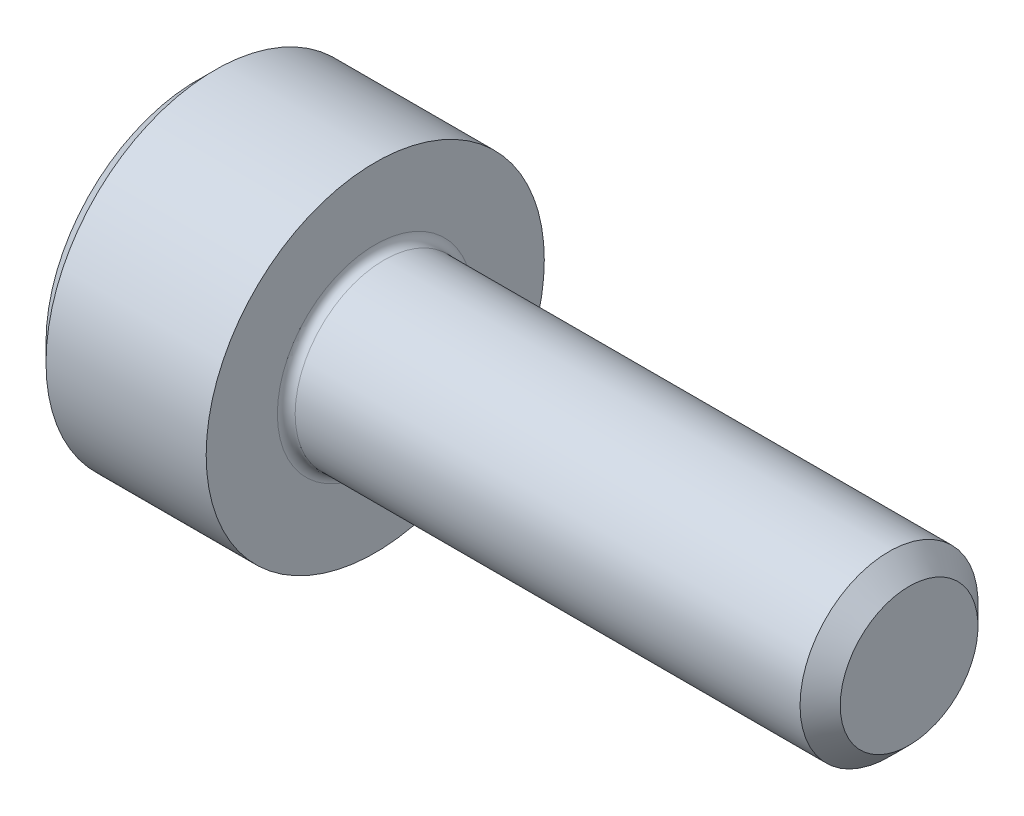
ISO-10303-21;
HEADER;
FILE_DESCRIPTION(('STEP AP214'),'2;1');
FILE_NAME('part.step','',(''),(''),'','','');
FILE_SCHEMA(('AUTOMOTIVE_DESIGN { 1 0 10303 214 1 1 1 1 }'));
ENDSEC;
DATA;
#1=APPLICATION_CONTEXT('core data for automotive mechanical design processes');
#2=APPLICATION_PROTOCOL_DEFINITION('international standard','automotive_design',2000,#1);
#3=PRODUCT_CONTEXT('',#1,'mechanical');
#4=PRODUCT('Part','Part','',(#3));
#5=PRODUCT_RELATED_PRODUCT_CATEGORY('part','',(#4));
#6=PRODUCT_DEFINITION_FORMATION('','',#4);
#7=PRODUCT_DEFINITION_CONTEXT('part definition',#1,'design');
#8=PRODUCT_DEFINITION('design','',#6,#7);
#9=PRODUCT_DEFINITION_SHAPE('','',#8);
#10=(LENGTH_UNIT() NAMED_UNIT(*) SI_UNIT(.MILLI.,.METRE.));
#11=(NAMED_UNIT(*) PLANE_ANGLE_UNIT() SI_UNIT($,.RADIAN.));
#12=(NAMED_UNIT(*) SI_UNIT($,.STERADIAN.) SOLID_ANGLE_UNIT());
#13=UNCERTAINTY_MEASURE_WITH_UNIT(LENGTH_MEASURE(1.E-05),#10,'distance_accuracy_value','');
#14=(GEOMETRIC_REPRESENTATION_CONTEXT(3) GLOBAL_UNCERTAINTY_ASSIGNED_CONTEXT((#13)) GLOBAL_UNIT_ASSIGNED_CONTEXT((#10,
#11,#12)) REPRESENTATION_CONTEXT('',''));
#15=CARTESIAN_POINT('',(0.,0.,0.));
#16=DIRECTION('',(0.,0.,1.));
#17=DIRECTION('',(1.,0.,0.));
#18=AXIS2_PLACEMENT_3D('',#15,#16,#17);
#19=CARTESIAN_POINT('',(0.,0.,0.));
#20=DIRECTION('',(-1.,0.,0.));
#21=DIRECTION('',(0.,0.,1.));
#22=AXIS2_PLACEMENT_3D('',#19,#20,#21);
#23=PLANE('',#22);
#24=DIRECTION('',(0.,-0.499999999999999,0.866025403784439));
#25=VECTOR('',#24,1.);
#26=CARTESIAN_POINT('',(0.,0.892006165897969,0.));
#27=LINE('',#26,#25);
#28=CARTESIAN_POINT('',(0.,0.892006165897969,0.));
#29=VERTEX_POINT('',#28);
#30=CARTESIAN_POINT('',(0.,0.446003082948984,0.772499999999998));
#31=VERTEX_POINT('',#30);
#32=EDGE_CURVE('E260',#29,#31,#27,.T.);
#33=ORIENTED_EDGE('',*,*,#32,.T.);
#34=DIRECTION('',(0.,1.,0.));
#35=VECTOR('',#34,1.);
#36=CARTESIAN_POINT('',(0.,-0.446003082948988,0.772499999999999));
#37=LINE('',#36,#35);
#38=CARTESIAN_POINT('',(0.,-0.446003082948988,0.772499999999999));
#39=VERTEX_POINT('',#38);
#40=EDGE_CURVE('E131',#39,#31,#37,.T.);
#41=ORIENTED_EDGE('',*,*,#40,.F.);
#42=DIRECTION('',(0.,-0.500000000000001,-0.866025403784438));
#43=VECTOR('',#42,1.);
#44=CARTESIAN_POINT('',(0.,-0.446003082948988,0.772499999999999));
#45=LINE('',#44,#43);
#46=CARTESIAN_POINT('',(0.,-0.892006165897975,0.));
#47=VERTEX_POINT('',#46);
#48=EDGE_CURVE('E263',#39,#47,#45,.T.);
#49=ORIENTED_EDGE('',*,*,#48,.T.);
#50=DIRECTION('',(0.,0.499999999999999,-0.866025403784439));
#51=VECTOR('',#50,1.);
#52=CARTESIAN_POINT('',(0.,-0.892006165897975,0.));
#53=LINE('',#52,#51);
#54=CARTESIAN_POINT('',(0.,-0.44600308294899,-0.772500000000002));
#55=VERTEX_POINT('',#54);
#56=EDGE_CURVE('E266',#47,#55,#53,.T.);
#57=ORIENTED_EDGE('',*,*,#56,.T.);
#58=DIRECTION('',(0.,-1.,0.));
#59=VECTOR('',#58,1.);
#60=CARTESIAN_POINT('',(0.,0.446003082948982,-0.772500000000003));
#61=LINE('',#60,#59);
#62=CARTESIAN_POINT('',(0.,0.446003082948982,-0.772500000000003));
#63=VERTEX_POINT('',#62);
#64=EDGE_CURVE('E269',#63,#55,#61,.T.);
#65=ORIENTED_EDGE('',*,*,#64,.F.);
#66=DIRECTION('',(0.,-0.500000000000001,-0.866025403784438));
#67=VECTOR('',#66,1.);
#68=CARTESIAN_POINT('',(0.,0.892006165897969,0.));
#69=LINE('',#68,#67);
#70=EDGE_CURVE('E126',#29,#63,#69,.T.);
#71=ORIENTED_EDGE('',*,*,#70,.F.);
#72=EDGE_LOOP('',(#33,#41,#49,#57,#65,#71));
#73=FACE_BOUND('',#72,.T.);
#74=CARTESIAN_POINT('',(0.,0.,0.));
#75=DIRECTION('',(-1.,0.,0.));
#76=DIRECTION('',(0.,0.,1.));
#77=AXIS2_PLACEMENT_3D('',#74,#75,#76);
#78=CIRCLE('',#77,1.7);
#79=CARTESIAN_POINT('',(0.,0.,1.7));
#80=VERTEX_POINT('',#79);
#81=EDGE_CURVE('E155',#80,#80,#78,.T.);
#82=ORIENTED_EDGE('',*,*,#81,.T.);
#83=EDGE_LOOP('',(#82));
#84=FACE_BOUND('',#83,.T.);
#85=ADVANCED_FACE('F35',(#73,#84),#23,.T.);
#86=CARTESIAN_POINT('',(0.,0.,0.));
#87=DIRECTION('',(1.,0.,0.));
#88=DIRECTION('',(0.,0.,-1.));
#89=AXIS2_PLACEMENT_3D('',#86,#87,#88);
#90=CONICAL_SURFACE('',#89,1.7,0.785398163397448);
#91=CARTESIAN_POINT('',(0.199999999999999,0.,0.));
#92=DIRECTION('',(-1.,0.,0.));
#93=DIRECTION('',(0.,0.,1.));
#94=AXIS2_PLACEMENT_3D('',#91,#92,#93);
#95=CIRCLE('',#94,1.9);
#96=CARTESIAN_POINT('',(0.199999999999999,0.,1.9));
#97=VERTEX_POINT('',#96);
#98=EDGE_CURVE('E152',#97,#97,#95,.T.);
#99=ORIENTED_EDGE('',*,*,#98,.T.);
#100=EDGE_LOOP('',(#99));
#101=FACE_BOUND('',#100,.T.);
#102=ORIENTED_EDGE('',*,*,#81,.F.);
#103=EDGE_LOOP('',(#102));
#104=FACE_BOUND('',#103,.T.);
#105=ADVANCED_FACE('F176',(#101,#104),#90,.T.);
#106=CARTESIAN_POINT('',(-31.75,0.,0.));
#107=DIRECTION('',(-1.,0.,0.));
#108=DIRECTION('',(0.,0.,1.));
#109=AXIS2_PLACEMENT_3D('',#106,#107,#108);
#110=CYLINDRICAL_SURFACE('',#109,1.9);
#111=CARTESIAN_POINT('',(2.,0.,0.));
#112=DIRECTION('',(-1.,0.,0.));
#113=DIRECTION('',(0.,0.,1.));
#114=AXIS2_PLACEMENT_3D('',#111,#112,#113);
#115=CIRCLE('',#114,1.9);
#116=CARTESIAN_POINT('',(2.,0.,1.9));
#117=VERTEX_POINT('',#116);
#118=EDGE_CURVE('E149',#117,#117,#115,.T.);
#119=ORIENTED_EDGE('',*,*,#118,.T.);
#120=EDGE_LOOP('',(#119));
#121=FACE_BOUND('',#120,.T.);
#122=ORIENTED_EDGE('',*,*,#98,.F.);
#123=EDGE_LOOP('',(#122));
#124=FACE_BOUND('',#123,.T.);
#125=ADVANCED_FACE('F181',(#121,#124),#110,.T.);
#126=CARTESIAN_POINT('',(2.,1.9,0.));
#127=DIRECTION('',(1.,0.,0.));
#128=DIRECTION('',(0.,0.,-1.));
#129=AXIS2_PLACEMENT_3D('',#126,#127,#128);
#130=PLANE('',#129);
#131=CARTESIAN_POINT('',(2.,0.,0.));
#132=DIRECTION('',(1.,0.,0.));
#133=DIRECTION('',(0.,0.,-1.));
#134=AXIS2_PLACEMENT_3D('',#131,#132,#133);
#135=CIRCLE('',#134,1.09999999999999);
#136=CARTESIAN_POINT('',(2.,0.,-1.09999999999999));
#137=VERTEX_POINT('',#136);
#138=EDGE_CURVE('E43',#137,#137,#135,.F.);
#139=ORIENTED_EDGE('',*,*,#138,.T.);
#140=EDGE_LOOP('',(#139));
#141=FACE_BOUND('',#140,.T.);
#142=ORIENTED_EDGE('',*,*,#118,.F.);
#143=EDGE_LOOP('',(#142));
#144=FACE_BOUND('',#143,.T.);
#145=ADVANCED_FACE('F160',(#141,#144),#130,.T.);
#146=CARTESIAN_POINT('',(-31.75,0.,0.));
#147=DIRECTION('',(-1.,0.,0.));
#148=DIRECTION('',(0.,0.,1.));
#149=AXIS2_PLACEMENT_3D('',#146,#147,#148);
#150=CYLINDRICAL_SURFACE('',#149,0.999999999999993);
#151=CARTESIAN_POINT('',(2.1,0.,0.));
#152=DIRECTION('',(1.,0.,0.));
#153=DIRECTION('',(0.,0.,-1.));
#154=AXIS2_PLACEMENT_3D('',#151,#152,#153);
#155=CIRCLE('',#154,0.999999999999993);
#156=CARTESIAN_POINT('',(2.1,0.,-0.999999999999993));
#157=VERTEX_POINT('',#156);
#158=EDGE_CURVE('E11',#157,#157,#155,.T.);
#159=ORIENTED_EDGE('',*,*,#158,.T.);
#160=EDGE_LOOP('',(#159));
#161=FACE_BOUND('',#160,.T.);
#162=CARTESIAN_POINT('',(7.774,0.,0.));
#163=DIRECTION('',(-1.,0.,0.));
#164=DIRECTION('',(0.,0.,1.));
#165=AXIS2_PLACEMENT_3D('',#162,#163,#164);
#166=CIRCLE('',#165,0.999999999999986);
#167=CARTESIAN_POINT('',(7.774,0.,0.999999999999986));
#168=VERTEX_POINT('',#167);
#169=EDGE_CURVE('E146',#168,#168,#166,.T.);
#170=ORIENTED_EDGE('',*,*,#169,.T.);
#171=EDGE_LOOP('',(#170));
#172=FACE_BOUND('',#171,.T.);
#173=ADVANCED_FACE('F191',(#161,#172),#150,.T.);
#174=CARTESIAN_POINT('',(8.,0.,0.));
#175=DIRECTION('',(-1.,0.,0.));
#176=DIRECTION('',(0.,0.,1.));
#177=AXIS2_PLACEMENT_3D('',#174,#175,#176);
#178=CONICAL_SURFACE('',#177,0.774,0.785398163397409);
#179=ORIENTED_EDGE('',*,*,#169,.F.);
#180=EDGE_LOOP('',(#179));
#181=FACE_BOUND('',#180,.T.);
#182=CARTESIAN_POINT('',(8.,0.,0.));
#183=DIRECTION('',(-1.,0.,0.));
#184=DIRECTION('',(0.,0.,1.));
#185=AXIS2_PLACEMENT_3D('',#182,#183,#184);
#186=CIRCLE('',#185,0.774);
#187=CARTESIAN_POINT('',(8.,0.,0.774));
#188=VERTEX_POINT('',#187);
#189=EDGE_CURVE('E142',#188,#188,#186,.T.);
#190=ORIENTED_EDGE('',*,*,#189,.T.);
#191=EDGE_LOOP('',(#190));
#192=FACE_BOUND('',#191,.T.);
#193=ADVANCED_FACE('F171',(#181,#192),#178,.T.);
#194=CARTESIAN_POINT('',(8.,0.774,0.));
#195=DIRECTION('',(1.,0.,0.));
#196=DIRECTION('',(0.,0.,-1.));
#197=AXIS2_PLACEMENT_3D('',#194,#195,#196);
#198=PLANE('',#197);
#199=ORIENTED_EDGE('',*,*,#189,.F.);
#200=EDGE_LOOP('',(#199));
#201=FACE_BOUND('',#200,.T.);
#202=ADVANCED_FACE('F164',(#201),#198,.T.);
#203=CARTESIAN_POINT('',(2.1,0.,0.));
#204=DIRECTION('',(1.,0.,0.));
#205=DIRECTION('',(0.,0.,-1.));
#206=AXIS2_PLACEMENT_3D('',#203,#204,#205);
#207=TOROIDAL_SURFACE('',#206,1.09999999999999,0.1);
#208=ORIENTED_EDGE('',*,*,#158,.F.);
#209=EDGE_LOOP('',(#208));
#210=FACE_BOUND('',#209,.T.);
#211=ORIENTED_EDGE('',*,*,#138,.F.);
#212=EDGE_LOOP('',(#211));
#213=FACE_BOUND('',#212,.T.);
#214=ADVANCED_FACE('F37',(#210,#213),#207,.F.);
#215=CARTESIAN_POINT('',(1.,0.892006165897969,0.));
#216=DIRECTION('',(0.,-0.866025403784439,-0.499999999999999));
#217=DIRECTION('',(0.,0.499999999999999,-0.866025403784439));
#218=AXIS2_PLACEMENT_3D('',#215,#216,#217);
#219=PLANE('',#218);
#220=ORIENTED_EDGE('',*,*,#32,.F.);
#221=DIRECTION('',(-1.,0.,0.));
#222=VECTOR('',#221,1.);
#223=CARTESIAN_POINT('',(1.,0.892006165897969,0.));
#224=LINE('',#223,#222);
#225=CARTESIAN_POINT('',(1.,0.892006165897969,0.));
#226=VERTEX_POINT('',#225);
#227=EDGE_CURVE('E250',#226,#29,#224,.T.);
#228=ORIENTED_EDGE('',*,*,#227,.F.);
#229=DIRECTION('',(0.,-0.499999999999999,0.866025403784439));
#230=VECTOR('',#229,1.);
#231=CARTESIAN_POINT('',(1.,0.892006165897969,0.));
#232=LINE('',#231,#230);
#233=CARTESIAN_POINT('',(1.,0.669004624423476,0.386249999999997));
#234=VERTEX_POINT('',#233);
#235=EDGE_CURVE('E118',#226,#234,#232,.T.);
#236=ORIENTED_EDGE('',*,*,#235,.T.);
#237=CARTESIAN_POINT('',(1.,0.446003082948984,0.772499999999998));
#238=VERTEX_POINT('',#237);
#239=EDGE_CURVE('E109',#234,#238,#232,.T.);
#240=ORIENTED_EDGE('',*,*,#239,.T.);
#241=DIRECTION('',(-1.,0.,0.));
#242=VECTOR('',#241,1.);
#243=CARTESIAN_POINT('',(1.,0.446003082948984,0.772499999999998));
#244=LINE('',#243,#242);
#245=EDGE_CURVE('E123',#238,#31,#244,.T.);
#246=ORIENTED_EDGE('',*,*,#245,.T.);
#247=EDGE_LOOP('',(#220,#228,#236,#240,#246));
#248=FACE_BOUND('',#247,.T.);
#249=ADVANCED_FACE('F122',(#248),#219,.T.);
#250=CARTESIAN_POINT('',(1.,-0.446003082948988,0.772499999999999));
#251=DIRECTION('',(0.,0.,1.));
#252=DIRECTION('',(0.,-1.,0.));
#253=AXIS2_PLACEMENT_3D('',#250,#251,#252);
#254=PLANE('',#253);
#255=ORIENTED_EDGE('',*,*,#40,.T.);
#256=ORIENTED_EDGE('',*,*,#245,.F.);
#257=DIRECTION('',(0.,1.,0.));
#258=VECTOR('',#257,1.);
#259=CARTESIAN_POINT('',(1.,-0.446003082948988,0.772499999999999));
#260=LINE('',#259,#258);
#261=CARTESIAN_POINT('',(1.,0.,0.772499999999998));
#262=VERTEX_POINT('',#261);
#263=EDGE_CURVE('E106',#262,#238,#260,.T.);
#264=ORIENTED_EDGE('',*,*,#263,.F.);
#265=CARTESIAN_POINT('',(1.,-0.446003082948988,0.772499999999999));
#266=VERTEX_POINT('',#265);
#267=EDGE_CURVE('E117',#266,#262,#260,.T.);
#268=ORIENTED_EDGE('',*,*,#267,.F.);
#269=DIRECTION('',(-1.,0.,0.));
#270=VECTOR('',#269,1.);
#271=CARTESIAN_POINT('',(1.,-0.446003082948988,0.772499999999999));
#272=LINE('',#271,#270);
#273=EDGE_CURVE('E133',#266,#39,#272,.T.);
#274=ORIENTED_EDGE('',*,*,#273,.T.);
#275=EDGE_LOOP('',(#255,#256,#264,#268,#274));
#276=FACE_BOUND('',#275,.T.);
#277=ADVANCED_FACE('F128',(#276),#254,.F.);
#278=CARTESIAN_POINT('',(1.,-0.446003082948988,0.772499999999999));
#279=DIRECTION('',(0.,0.866025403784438,-0.500000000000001));
#280=DIRECTION('',(0.,0.500000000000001,0.866025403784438));
#281=AXIS2_PLACEMENT_3D('',#278,#279,#280);
#282=PLANE('',#281);
#283=ORIENTED_EDGE('',*,*,#48,.F.);
#284=ORIENTED_EDGE('',*,*,#273,.F.);
#285=DIRECTION('',(0.,-0.500000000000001,-0.866025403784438));
#286=VECTOR('',#285,1.);
#287=CARTESIAN_POINT('',(1.,-0.446003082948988,0.772499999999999));
#288=LINE('',#287,#286);
#289=CARTESIAN_POINT('',(1.,-0.66900462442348,0.386250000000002));
#290=VERTEX_POINT('',#289);
#291=EDGE_CURVE('E289',#266,#290,#288,.T.);
#292=ORIENTED_EDGE('',*,*,#291,.T.);
#293=CARTESIAN_POINT('',(1.,-0.892006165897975,0.));
#294=VERTEX_POINT('',#293);
#295=EDGE_CURVE('E278',#290,#294,#288,.T.);
#296=ORIENTED_EDGE('',*,*,#295,.T.);
#297=DIRECTION('',(-1.,0.,0.));
#298=VECTOR('',#297,1.);
#299=CARTESIAN_POINT('',(1.,-0.892006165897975,0.));
#300=LINE('',#299,#298);
#301=EDGE_CURVE('E138',#294,#47,#300,.T.);
#302=ORIENTED_EDGE('',*,*,#301,.T.);
#303=EDGE_LOOP('',(#283,#284,#292,#296,#302));
#304=FACE_BOUND('',#303,.T.);
#305=ADVANCED_FACE('F204',(#304),#282,.T.);
#306=CARTESIAN_POINT('',(1.,-0.892006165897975,0.));
#307=DIRECTION('',(0.,0.866025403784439,0.499999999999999));
#308=DIRECTION('',(0.,-0.499999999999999,0.866025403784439));
#309=AXIS2_PLACEMENT_3D('',#306,#307,#308);
#310=PLANE('',#309);
#311=ORIENTED_EDGE('',*,*,#56,.F.);
#312=ORIENTED_EDGE('',*,*,#301,.F.);
#313=DIRECTION('',(0.,0.499999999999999,-0.866025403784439));
#314=VECTOR('',#313,1.);
#315=CARTESIAN_POINT('',(1.,-0.892006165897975,0.));
#316=LINE('',#315,#314);
#317=CARTESIAN_POINT('',(1.,-0.669004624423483,-0.386250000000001));
#318=VERTEX_POINT('',#317);
#319=EDGE_CURVE('E256',#294,#318,#316,.T.);
#320=ORIENTED_EDGE('',*,*,#319,.T.);
#321=CARTESIAN_POINT('',(1.,-0.44600308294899,-0.772500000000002));
#322=VERTEX_POINT('',#321);
#323=EDGE_CURVE('E288',#318,#322,#316,.T.);
#324=ORIENTED_EDGE('',*,*,#323,.T.);
#325=DIRECTION('',(-1.,0.,0.));
#326=VECTOR('',#325,1.);
#327=CARTESIAN_POINT('',(1.,-0.44600308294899,-0.772500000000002));
#328=LINE('',#327,#326);
#329=EDGE_CURVE('E249',#322,#55,#328,.T.);
#330=ORIENTED_EDGE('',*,*,#329,.T.);
#331=EDGE_LOOP('',(#311,#312,#320,#324,#330));
#332=FACE_BOUND('',#331,.T.);
#333=ADVANCED_FACE('F207',(#332),#310,.T.);
#334=CARTESIAN_POINT('',(1.,0.446003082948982,-0.772500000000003));
#335=DIRECTION('',(0.,0.,-1.));
#336=DIRECTION('',(0.,1.,0.));
#337=AXIS2_PLACEMENT_3D('',#334,#335,#336);
#338=PLANE('',#337);
#339=ORIENTED_EDGE('',*,*,#64,.T.);
#340=ORIENTED_EDGE('',*,*,#329,.F.);
#341=DIRECTION('',(0.,-1.,0.));
#342=VECTOR('',#341,1.);
#343=CARTESIAN_POINT('',(1.,0.446003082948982,-0.772500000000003));
#344=LINE('',#343,#342);
#345=CARTESIAN_POINT('',(1.,0.,-0.7725));
#346=VERTEX_POINT('',#345);
#347=EDGE_CURVE('E253',#346,#322,#344,.T.);
#348=ORIENTED_EDGE('',*,*,#347,.F.);
#349=CARTESIAN_POINT('',(1.,0.446003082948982,-0.772500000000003));
#350=VERTEX_POINT('',#349);
#351=EDGE_CURVE('E50',#350,#346,#344,.T.);
#352=ORIENTED_EDGE('',*,*,#351,.F.);
#353=DIRECTION('',(-1.,0.,0.));
#354=VECTOR('',#353,1.);
#355=CARTESIAN_POINT('',(1.,0.446003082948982,-0.772500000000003));
#356=LINE('',#355,#354);
#357=EDGE_CURVE('E246',#350,#63,#356,.T.);
#358=ORIENTED_EDGE('',*,*,#357,.T.);
#359=EDGE_LOOP('',(#339,#340,#348,#352,#358));
#360=FACE_BOUND('',#359,.T.);
#361=ADVANCED_FACE('F211',(#360),#338,.F.);
#362=CARTESIAN_POINT('',(1.,0.892006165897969,0.));
#363=DIRECTION('',(0.,0.866025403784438,-0.500000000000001));
#364=DIRECTION('',(0.,0.500000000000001,0.866025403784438));
#365=AXIS2_PLACEMENT_3D('',#362,#363,#364);
#366=PLANE('',#365);
#367=ORIENTED_EDGE('',*,*,#70,.T.);
#368=ORIENTED_EDGE('',*,*,#357,.F.);
#369=DIRECTION('',(0.,-0.500000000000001,-0.866025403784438));
#370=VECTOR('',#369,1.);
#371=CARTESIAN_POINT('',(1.,0.892006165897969,0.));
#372=LINE('',#371,#370);
#373=CARTESIAN_POINT('',(1.,0.669004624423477,-0.38625));
#374=VERTEX_POINT('',#373);
#375=EDGE_CURVE('E236',#374,#350,#372,.T.);
#376=ORIENTED_EDGE('',*,*,#375,.F.);
#377=EDGE_CURVE('E242',#226,#374,#372,.T.);
#378=ORIENTED_EDGE('',*,*,#377,.F.);
#379=ORIENTED_EDGE('',*,*,#227,.T.);
#380=EDGE_LOOP('',(#367,#368,#376,#378,#379));
#381=FACE_BOUND('',#380,.T.);
#382=ADVANCED_FACE('F215',(#381),#366,.F.);
#383=CARTESIAN_POINT('',(1.,1.33800924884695,-0.772500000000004));
#384=DIRECTION('',(1.,0.,0.));
#385=DIRECTION('',(0.,0.,-1.));
#386=AXIS2_PLACEMENT_3D('',#383,#384,#385);
#387=PLANE('',#386);
#388=ORIENTED_EDGE('',*,*,#347,.T.);
#389=ORIENTED_EDGE('',*,*,#323,.F.);
#390=CARTESIAN_POINT('',(1.,0.,0.));
#391=DIRECTION('',(-1.,0.,0.));
#392=DIRECTION('',(0.,0.,1.));
#393=AXIS2_PLACEMENT_3D('',#390,#391,#392);
#394=CIRCLE('',#393,0.7725);
#395=EDGE_CURVE('E284',#346,#318,#394,.T.);
#396=ORIENTED_EDGE('',*,*,#395,.F.);
#397=EDGE_LOOP('',(#388,#389,#396));
#398=FACE_BOUND('',#397,.T.);
#399=ADVANCED_FACE('F219',(#398),#387,.F.);
#400=ORIENTED_EDGE('',*,*,#319,.F.);
#401=ORIENTED_EDGE('',*,*,#295,.F.);
#402=EDGE_CURVE('E136',#318,#290,#394,.T.);
#403=ORIENTED_EDGE('',*,*,#402,.F.);
#404=EDGE_LOOP('',(#400,#401,#403));
#405=FACE_BOUND('',#404,.T.);
#406=ADVANCED_FACE('F222',(#405),#387,.F.);
#407=ORIENTED_EDGE('',*,*,#291,.F.);
#408=ORIENTED_EDGE('',*,*,#267,.T.);
#409=EDGE_CURVE('E132',#290,#262,#394,.T.);
#410=ORIENTED_EDGE('',*,*,#409,.F.);
#411=EDGE_LOOP('',(#407,#408,#410));
#412=FACE_BOUND('',#411,.T.);
#413=ADVANCED_FACE('F227',(#412),#387,.F.);
#414=ORIENTED_EDGE('',*,*,#263,.T.);
#415=ORIENTED_EDGE('',*,*,#239,.F.);
#416=EDGE_CURVE('E112',#262,#234,#394,.T.);
#417=ORIENTED_EDGE('',*,*,#416,.F.);
#418=EDGE_LOOP('',(#414,#415,#417));
#419=FACE_BOUND('',#418,.T.);
#420=ADVANCED_FACE('F108',(#419),#387,.F.);
#421=ORIENTED_EDGE('',*,*,#235,.F.);
#422=ORIENTED_EDGE('',*,*,#377,.T.);
#423=EDGE_CURVE('E143',#234,#374,#394,.T.);
#424=ORIENTED_EDGE('',*,*,#423,.F.);
#425=EDGE_LOOP('',(#421,#422,#424));
#426=FACE_BOUND('',#425,.T.);
#427=ADVANCED_FACE('F230',(#426),#387,.F.);
#428=ORIENTED_EDGE('',*,*,#375,.T.);
#429=ORIENTED_EDGE('',*,*,#351,.T.);
#430=EDGE_CURVE('E239',#374,#346,#394,.T.);
#431=ORIENTED_EDGE('',*,*,#430,.F.);
#432=EDGE_LOOP('',(#428,#429,#431));
#433=FACE_BOUND('',#432,.T.);
#434=ADVANCED_FACE('F200',(#433),#387,.F.);
#435=CARTESIAN_POINT('',(1.,0.,0.));
#436=DIRECTION('',(-1.,0.,0.));
#437=DIRECTION('',(0.,0.,1.));
#438=AXIS2_PLACEMENT_3D('',#435,#436,#437);
#439=CONICAL_SURFACE('',#438,0.7725,1.04719755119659);
#440=CARTESIAN_POINT('',(1.446003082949,0.,0.));
#441=VERTEX_POINT('',#440);
#442=VERTEX_LOOP('',#441);
#443=FACE_BOUND('',#442,.T.);
#444=ORIENTED_EDGE('',*,*,#416,.T.);
#445=ORIENTED_EDGE('',*,*,#423,.T.);
#446=ORIENTED_EDGE('',*,*,#430,.T.);
#447=ORIENTED_EDGE('',*,*,#395,.T.);
#448=ORIENTED_EDGE('',*,*,#402,.T.);
#449=ORIENTED_EDGE('',*,*,#409,.T.);
#450=EDGE_LOOP('',(#444,#445,#446,#447,#448,#449));
#451=FACE_BOUND('',#450,.T.);
#452=ADVANCED_FACE('F198',(#443,#451),#439,.F.);
#453=CLOSED_SHELL('',(#85,#105,#125,#145,#173,#193,#202,#214,#249,#277,#305,#333,#361,#382,#399,
#406,#413,#420,#427,#434,#452));
#454=MANIFOLD_SOLID_BREP('B2',#453);
#455=ADVANCED_BREP_SHAPE_REPRESENTATION('',(#18,#454),#14);
#456=SHAPE_DEFINITION_REPRESENTATION(#9,#455);
ENDSEC;
END-ISO-10303-21;
